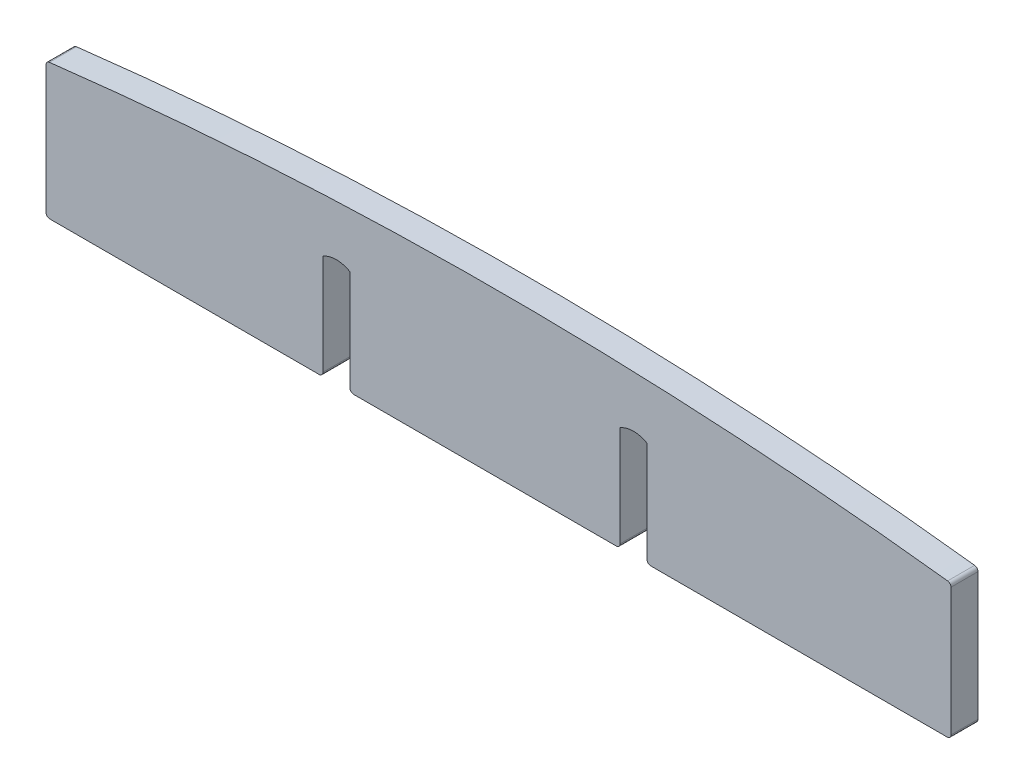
from build123d import *

# Parameters (mm, degrees)
RESSALTO_EXTRUS_O1_DEPTH = 2


with BuildPart() as part:
    # Esbo_o1 → Ressalto-extrus_o1 (new body)
    with BuildSketch(Plane.XY):
        with BuildLine():
            Line((-9.717847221, -7.732050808), (9.717847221, -7.732050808))
            ThreePointArc((9.717847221, -7.732050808), (9.917359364, -7.649410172), (10, -7.449898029))
            Line((10, -7.449898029), (10, 0))
            ThreePointArc((10, 0), (11, 0.267949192), (12, 0))
            Line((12, 0), (12, -7.449898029))
            ThreePointArc((12, -7.449898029), (12.082640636, -7.649410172), (12.282152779, -7.732050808))
            Line((12.282152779, -7.732050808), (34.217847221, -7.732050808))
            ThreePointArc((34.217847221, -7.732050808), (34.417359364, -7.649410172), (34.5, -7.449898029))
            Line((34.5, -7.449898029), (34.5, 2.017476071))
            ThreePointArc((34.5, 2.017476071), (34.428811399, 2.204837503), (34.251168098, 2.297654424))
            ThreePointArc((34.251168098, 2.297654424), (1, 4.267949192), (-32.251168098, 2.297654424))
            ThreePointArc((-32.251168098, 2.297654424), (-32.428811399, 2.204837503), (-32.5, 2.017476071))
            Line((-32.5, 2.017476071), (-32.5, -7.449898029))
            ThreePointArc((-32.5, -7.449898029), (-32.417359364, -7.649410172), (-32.217847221, -7.732050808))
            Line((-32.217847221, -7.732050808), (-12.282152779, -7.732050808))
            ThreePointArc((-12.282152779, -7.732050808), (-12.082640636, -7.649410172), (-12, -7.449898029))
            Line((-12, -7.449898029), (-12, 0))
            ThreePointArc((-12, 0), (-11, 0.267949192), (-10, 0))
            Line((-10, 0), (-10, -7.449898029))
            ThreePointArc((-10, -7.449898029), (-9.917359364, -7.649410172), (-9.717847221, -7.732050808))
        make_face()
    extrude(amount=RESSALTO_EXTRUS_O1_DEPTH)


solid = part.part
